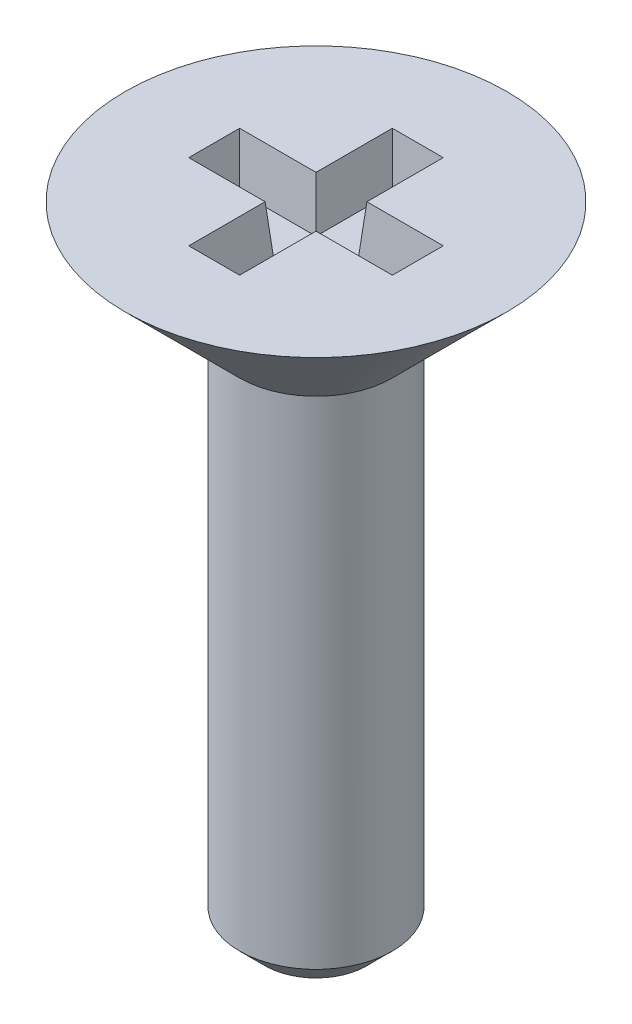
from build123d import *

# Parameters (mm, degrees)
CUT_EXTRUDE1_DEPTH = 2
CUT_EXTRUDE1_DRAFT = -5
CHAMFER1_SIZE      = 1


with BuildPart() as part:
    # Sketch1 → Revolve1 (revolve)
    with BuildSketch(Plane.XY, mode=Mode.PRIVATE) as revolve1_sk:
        Polygon((0, 0), (-3, 0), (-3, 20.5), (-7.5, 25), (0, 25), align=None)
    revolve(revolve1_sk.sketch.rotate(Axis((0, 0, 0), (0, -1, 0)), 270), axis=Axis((0, 0, 0), (0, -1, 0)))


with BuildPart() as cut_extrude1_tool:
    # Sketch2 → Cut-Extrude1 (with draft: the straight prism first)
    with BuildSketch(Plane(origin=(0, 25, 0), x_dir=(1, 0, 0), z_dir=(0, 1, 0))):
        Polygon((-4, 1), (-4, -1), (-1, -1), (-1, -4), (1, -4), (1, -1), (4, -1), (4, 1), (1, 1), (1, 4), (-1, 4), (-1, 1), align=None)
    extrude(amount=-CUT_EXTRUDE1_DEPTH)
    # Cut-Extrude1: the draft: its side faces are tilted about the plane it starts from
    cut_extrude1_sides = [cut_extrude1_tool.faces().sort_by_distance(p)[0] for p in [
        (-4, 24, 0),
        (-2.5, 24, 1),
        (-1, 24, 2.5),
        (0, 24, 4),
        (1, 24, 2.5),
        (2.5, 24, 1),
        (4, 24, 0),
        (2.5, 24, -1),
        (1, 24, -2.5),
        (0, 24, -4),
        (-1, 24, -2.5),
        (-2.5, 24, -1),
    ]]
    draft(cut_extrude1_sides, Plane(origin=(0, 25, 0), x_dir=(1, 0, 0), z_dir=(0, 1, 0)), CUT_EXTRUDE1_DRAFT)


with BuildPart() as part_1:
    add(part.part)

    # Cut-Extrude1: cut by cut_extrude1_tool
    add(cut_extrude1_tool.part, mode=Mode.SUBTRACT)

    # Chamfer1
    chamfer1_edges = [part_1.edges().sort_by_distance(p)[0] for p in [
        (0, 0, -3),
    ]]
    chamfer(chamfer1_edges, length=CHAMFER1_SIZE)


solid = part_1.part
